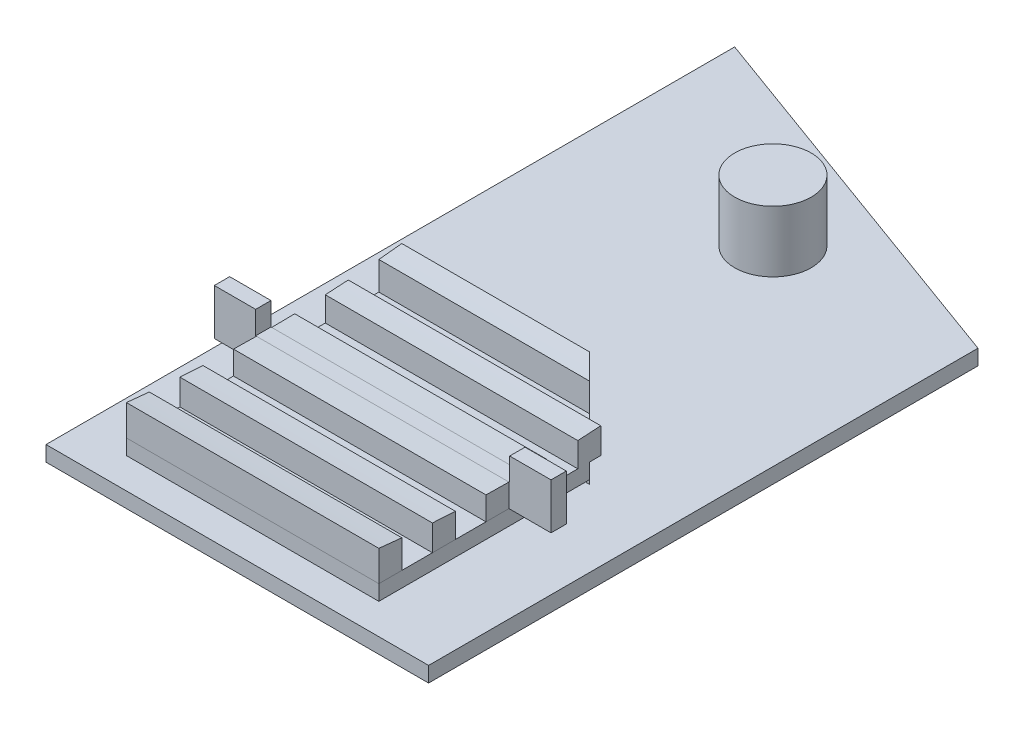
from build123d import *

# Parameters (mm, degrees)
BOSS_EXTRU_1_DEPTH           = 1
BOSS_EXTRU_2_START           = 2
BOSS_EXTRU_2_DEPTH           = 2
ESQUISSE2_W                  = 16.5
ESQUISSE2_H                  = 1.5
BOSS_EXTRU_2_2_DEPTH         = 2
BOSS_EXTRU_2_3_DEPTH         = 2
BOSS_EXTRU_2_4_DEPTH         = 2
BOSS_EXTRU_2_5_DEPTH         = 2
BOSS_EXTRU_2_6_DEPTH         = 2
ESQUISSE2_R                  = 2.5
BOSS_EXTRU_2_7_DEPTH         = 2
ENL_V_MAT_EXTRU_1_DEPTH      = 50.714811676
BOSS_EXTRU_3_START           = 1
BOSS_EXTRU_3_DEPTH           = 1
ESQUISSE5_W                  = 22
ESQUISSE5_H                  = 1
BOSS_EXTRU_4_DEPTH           = 3
ESQUISSE6_R                  = 2.5
BOSS_EXTRU_6_DEPTH           = 2
ENL_V_MAT_EXTRU_2_DEPTH      = 8.3
ENL_V_MAT_EXTRU_2_DEPTH_BACK = 8.3


with BuildPart() as part:
    # Esquisse1 → Boss.-Extru.1 (new body)
    with BuildSketch(Plane(origin=(0, 0, 0), x_dir=(1, 0, 0), z_dir=(0, 1, 0))):
        Polygon((-12.5, 0), (12.5, 0), (12.5, 35.900744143), (-12.5, 45), align=None)
    extrude(amount=-BOSS_EXTRU_1_DEPTH)



with BuildPart() as body_2:
    # Esquisse2 → Boss.-Extru.2 (new body)
    with BuildSketch(Plane(origin=(0, 0, 0), x_dir=(1, 0, 0), z_dir=(0, 1, 0)).offset(BOSS_EXTRU_2_START)):
        Polygon((-8.25, 19), (-8.25, 17.5), (5.5, 17.5), (4, 19), align=None)
    extrude(amount=BOSS_EXTRU_2_DEPTH)


with BuildPart() as body_3:
    # Esquisse2 → Boss.-Extru.2 2 (new body)
    with BuildSketch(Plane(origin=(0, 0, 0), x_dir=(1, 0, 0), z_dir=(0, 1, 0)).offset(BOSS_EXTRU_2_START)):
        with Locations((0, 1.75)):
            Rectangle(ESQUISSE2_W, ESQUISSE2_H)
    extrude(amount=BOSS_EXTRU_2_2_DEPTH)


with BuildPart() as body_4:
    # Esquisse2 → Boss.-Extru.2 3 (new body)
    with BuildSketch(Plane(origin=(0, 0, 0), x_dir=(1, 0, 0), z_dir=(0, 1, 0)).offset(BOSS_EXTRU_2_START)):
        with Locations((0, 5.25)):
            Rectangle(ESQUISSE2_W, ESQUISSE2_H)
    extrude(amount=BOSS_EXTRU_2_3_DEPTH)


with BuildPart() as body_5:
    # Esquisse2 → Boss.-Extru.2 4 (new body)
    with BuildSketch(Plane(origin=(0, 0, 0), x_dir=(1, 0, 0), z_dir=(0, 1, 0)).offset(BOSS_EXTRU_2_START)):
        with Locations((0, 8.75)):
            Rectangle(ESQUISSE2_W, ESQUISSE2_H)
    extrude(amount=BOSS_EXTRU_2_4_DEPTH)


with BuildPart() as body_6:
    # Esquisse2 → Boss.-Extru.2 5 (new body)
    with BuildSketch(Plane(origin=(0, 0, 0), x_dir=(1, 0, 0), z_dir=(0, 1, 0)).offset(BOSS_EXTRU_2_START)):
        with Locations((0, 11.25)):
            Rectangle(ESQUISSE2_W, ESQUISSE2_H)
    extrude(amount=BOSS_EXTRU_2_5_DEPTH)


with BuildPart() as body_7:
    # Esquisse2 → Boss.-Extru.2 6 (new body)
    with BuildSketch(Plane(origin=(0, 0, 0), x_dir=(1, 0, 0), z_dir=(0, 1, 0)).offset(BOSS_EXTRU_2_START)):
        with Locations((0, 14.75)):
            Rectangle(ESQUISSE2_W, ESQUISSE2_H)
    extrude(amount=BOSS_EXTRU_2_6_DEPTH)


with BuildPart() as body_8:
    # Esquisse2 → Boss.-Extru.2 7 (new body)
    with BuildSketch(Plane(origin=(0, 0, 0), x_dir=(1, 0, 0), z_dir=(0, 1, 0)).offset(BOSS_EXTRU_2_START)):
        with Locations(Location((0, 35, 0), (0, 0, 270))):
            Circle(ESQUISSE2_R)
    extrude(amount=BOSS_EXTRU_2_7_DEPTH)


with BuildPart() as enl_v_mat_extru_1_tool:
    # Esquisse3 → Enl_v. mat.-Extru.1 (new, through all)
    with BuildSketch(Plane.ZY.offset(8.25)):
        with BuildLine():
            Line((-19, 4), (-1, 4))
            add(Edge.make_bspline(
                [(-19, 4), (-10, 3), (-1, 4)],
                knots=[0, 0, 0, 1, 1, 1], degree=2))
        make_face()
    extrude(amount=-ENL_V_MAT_EXTRU_1_DEPTH)


with BuildPart() as body_2_1:
    add(body_2.part)

    # Enl_v. mat.-Extru.1: cut by enl_v_mat_extru_1_tool
    add(enl_v_mat_extru_1_tool.part, mode=Mode.SUBTRACT)


with BuildPart() as body_3_1:
    add(body_3.part)

    # Enl_v. mat.-Extru.1: cut by enl_v_mat_extru_1_tool
    add(enl_v_mat_extru_1_tool.part, mode=Mode.SUBTRACT)


with BuildPart() as body_4_1:
    add(body_4.part)

    # Enl_v. mat.-Extru.1: cut by enl_v_mat_extru_1_tool
    add(enl_v_mat_extru_1_tool.part, mode=Mode.SUBTRACT)


with BuildPart() as body_5_1:
    add(body_5.part)

    # Enl_v. mat.-Extru.1: cut by enl_v_mat_extru_1_tool
    add(enl_v_mat_extru_1_tool.part, mode=Mode.SUBTRACT)


with BuildPart() as body_6_1:
    add(body_6.part)

    # Enl_v. mat.-Extru.1: cut by enl_v_mat_extru_1_tool
    add(enl_v_mat_extru_1_tool.part, mode=Mode.SUBTRACT)


with BuildPart() as body_7_1:
    add(body_7.part)

    # Enl_v. mat.-Extru.1: cut by enl_v_mat_extru_1_tool
    add(enl_v_mat_extru_1_tool.part, mode=Mode.SUBTRACT)


with BuildPart() as body_9:
    # Esquisse4 → Boss.-Extru.3 (new body)
    with BuildSketch(Plane(origin=(0, 0, 0), x_dir=(1, 0, 0), z_dir=(0, 1, 0)).offset(BOSS_EXTRU_3_START)):
        Polygon((8.25, 1), (-8.25, 1), (-8.25, 19), (4, 19), (8.25, 14.75), align=None)
    extrude(amount=BOSS_EXTRU_3_DEPTH)


with BuildPart() as body_10:
    # Esquisse5 → Boss.-Extru.4 (new body)
    with BuildSketch(Plane(origin=(0, 2, 0), x_dir=(1, 0, 0), z_dir=(0, 1, 0))):
        with Locations((0, 10)):
            Rectangle(ESQUISSE5_W, ESQUISSE5_H)
    extrude(amount=BOSS_EXTRU_4_DEPTH)

    # Esquisse8 → Enl_v. mat.-Extru.2 (cut, two sides: drawn at the far end of the back side and taken through both)
    with BuildSketch(Plane(origin=(0, 0, 0), x_dir=(0, 0, -1), z_dir=(1, 0, 0)).offset(-ENL_V_MAT_EXTRU_2_DEPTH_BACK)):
        with BuildLine():
            ThreePointArc((17.5, 3.847222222), (18.250350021, 3.920174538), (19, 4))
            Line((19, 4), (1, 4))
            add(Edge.make_bspline(
                [(1, 4), (7.5, 3.277777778), (14, 3.598765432)],
                knots=[0, 0, 0, 0.722222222, 0.722222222, 0.722222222], degree=2))
            ThreePointArc((14, 3.598765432), (14.75020292, 3.639286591), (15.5, 3.686728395))
            add(Edge.make_bspline(
                [(15.5, 3.686728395), (16.5, 3.75462963), (17.5, 3.847222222)],
                knots=[0.805555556, 0.805555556, 0.805555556, 0.916666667, 0.916666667, 0.916666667], degree=2))
        make_face()
        Polygon((19, 4), (10, 6.418681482), (1, 4), align=None)
    extrude(amount=ENL_V_MAT_EXTRU_2_DEPTH + ENL_V_MAT_EXTRU_2_DEPTH_BACK, mode=Mode.SUBTRACT)


with BuildPart() as part_1:
    add(part.part)

    add(body_2_1.part)  # Boss.-Extru.6 merges body 2

    add(body_7_1.part)  # Boss.-Extru.6 merges body 7

    add(body_8.part)  # Boss.-Extru.6 merges body 8

    add(body_9.part)  # Boss.-Extru.6 merges body 9
    # Esquisse6 → Boss.-Extru.6 (add)
    with BuildSketch(Plane(origin=(0, 0, 0), x_dir=(1, 0, 0), z_dir=(0, 1, 0))):
        Polygon((-8.25, 15.5), (7.5, 15.5), (4, 19), (-8.25, 19), align=None)
        with Locations(Location((0, 35, 0), (0, 0, 270))):
            Circle(ESQUISSE6_R)
    extrude(amount=BOSS_EXTRU_6_DEPTH)


solid = Compound([body_3_1.part, body_4_1.part, body_5_1.part, body_6_1.part, body_10.part, part_1.part])
